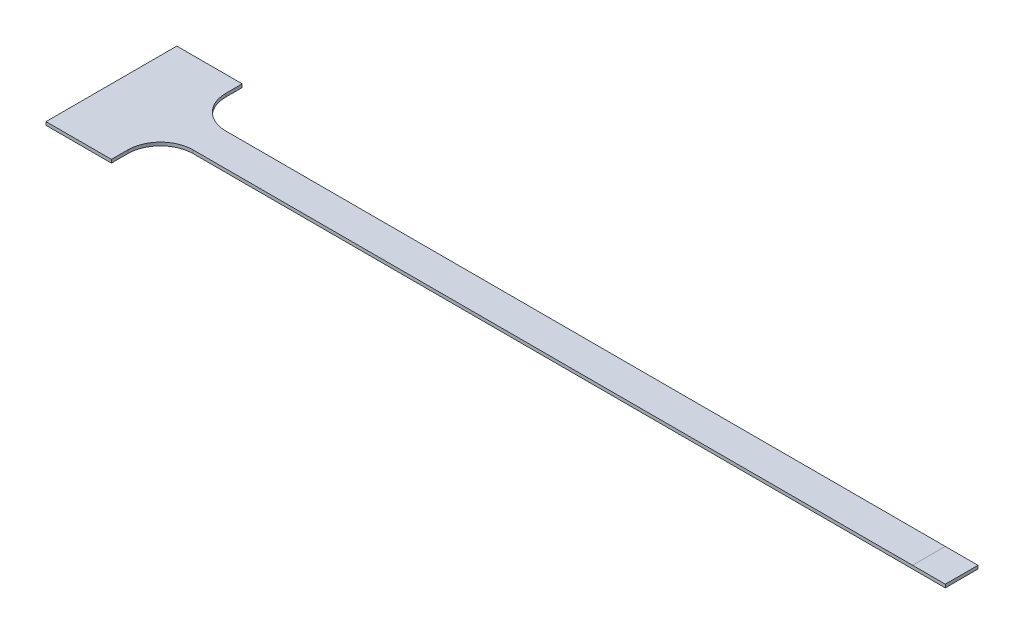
ISO-10303-21;
HEADER;
FILE_DESCRIPTION(('STEP AP214'),'2;1');
FILE_NAME('part.step','',(''),(''),'','','');
FILE_SCHEMA(('AUTOMOTIVE_DESIGN { 1 0 10303 214 1 1 1 1 }'));
ENDSEC;
DATA;
#1=APPLICATION_CONTEXT('core data for automotive mechanical design processes');
#2=APPLICATION_PROTOCOL_DEFINITION('international standard','automotive_design',2000,#1);
#3=PRODUCT_CONTEXT('',#1,'mechanical');
#4=PRODUCT('Part','Part','',(#3));
#5=PRODUCT_RELATED_PRODUCT_CATEGORY('part','',(#4));
#6=PRODUCT_DEFINITION_FORMATION('','',#4);
#7=PRODUCT_DEFINITION_CONTEXT('part definition',#1,'design');
#8=PRODUCT_DEFINITION('design','',#6,#7);
#9=PRODUCT_DEFINITION_SHAPE('','',#8);
#10=(LENGTH_UNIT() NAMED_UNIT(*) SI_UNIT(.MILLI.,.METRE.));
#11=(NAMED_UNIT(*) PLANE_ANGLE_UNIT() SI_UNIT($,.RADIAN.));
#12=(NAMED_UNIT(*) SI_UNIT($,.STERADIAN.) SOLID_ANGLE_UNIT());
#13=UNCERTAINTY_MEASURE_WITH_UNIT(LENGTH_MEASURE(1.E-05),#10,'distance_accuracy_value','');
#14=(GEOMETRIC_REPRESENTATION_CONTEXT(3) GLOBAL_UNCERTAINTY_ASSIGNED_CONTEXT((#13)) GLOBAL_UNIT_ASSIGNED_CONTEXT((#10,
#11,#12)) REPRESENTATION_CONTEXT('',''));
#15=CARTESIAN_POINT('',(0.,0.,0.));
#16=DIRECTION('',(0.,0.,1.));
#17=DIRECTION('',(1.,0.,0.));
#18=AXIS2_PLACEMENT_3D('',#15,#16,#17);
#19=CARTESIAN_POINT('',(-480.,1.,10.));
#20=DIRECTION('',(0.,1.,0.));
#21=DIRECTION('',(0.,0.,1.));
#22=AXIS2_PLACEMENT_3D('',#19,#20,#21);
#23=PLANE('',#22);
#24=DIRECTION('',(1.,0.,0.));
#25=VECTOR('',#24,1.);
#26=CARTESIAN_POINT('',(-480.,1.,10.));
#27=LINE('',#26,#25);
#28=CARTESIAN_POINT('',(-460.,1.,10.));
#29=VERTEX_POINT('',#28);
#30=CARTESIAN_POINT('',(-20.,1.,10.));
#31=VERTEX_POINT('',#30);
#32=EDGE_CURVE('E188',#29,#31,#27,.T.);
#33=ORIENTED_EDGE('',*,*,#32,.T.);
#34=DIRECTION('',(0.,0.,-1.));
#35=VECTOR('',#34,1.);
#36=CARTESIAN_POINT('',(-20.,1.,10.));
#37=LINE('',#36,#35);
#38=CARTESIAN_POINT('',(-20.,1.,-10.));
#39=VERTEX_POINT('',#38);
#40=EDGE_CURVE('E11',#31,#39,#37,.T.);
#41=ORIENTED_EDGE('',*,*,#40,.T.);
#42=DIRECTION('',(1.,0.,0.));
#43=VECTOR('',#42,1.);
#44=CARTESIAN_POINT('',(-480.,1.,-10.));
#45=LINE('',#44,#43);
#46=CARTESIAN_POINT('',(-460.,1.,-10.));
#47=VERTEX_POINT('',#46);
#48=EDGE_CURVE('E178',#47,#39,#45,.T.);
#49=ORIENTED_EDGE('',*,*,#48,.F.);
#50=CARTESIAN_POINT('',(-460.,1.,-30.));
#51=DIRECTION('',(0.,1.,0.));
#52=DIRECTION('',(0.,0.,1.));
#53=AXIS2_PLACEMENT_3D('',#50,#51,#52);
#54=CIRCLE('',#53,20.);
#55=CARTESIAN_POINT('',(-480.,1.,-30.));
#56=VERTEX_POINT('',#55);
#57=EDGE_CURVE('E227',#47,#56,#54,.F.);
#58=ORIENTED_EDGE('',*,*,#57,.T.);
#59=DIRECTION('',(0.,0.,-1.));
#60=VECTOR('',#59,1.);
#61=CARTESIAN_POINT('',(-480.,1.,-40.));
#62=LINE('',#61,#60);
#63=CARTESIAN_POINT('',(-480.,1.,-40.));
#64=VERTEX_POINT('',#63);
#65=EDGE_CURVE('E231',#56,#64,#62,.T.);
#66=ORIENTED_EDGE('',*,*,#65,.T.);
#67=DIRECTION('',(1.,0.,0.));
#68=VECTOR('',#67,1.);
#69=CARTESIAN_POINT('',(-520.,1.,-40.));
#70=LINE('',#69,#68);
#71=CARTESIAN_POINT('',(-520.,1.,-40.));
#72=VERTEX_POINT('',#71);
#73=EDGE_CURVE('E147',#72,#64,#70,.T.);
#74=ORIENTED_EDGE('',*,*,#73,.F.);
#75=DIRECTION('',(0.,0.,-1.));
#76=VECTOR('',#75,1.);
#77=CARTESIAN_POINT('',(-520.,1.,-40.));
#78=LINE('',#77,#76);
#79=CARTESIAN_POINT('',(-520.,1.,40.));
#80=VERTEX_POINT('',#79);
#81=EDGE_CURVE('E240',#80,#72,#78,.T.);
#82=ORIENTED_EDGE('',*,*,#81,.F.);
#83=DIRECTION('',(1.,0.,0.));
#84=VECTOR('',#83,1.);
#85=CARTESIAN_POINT('',(-520.,1.,40.));
#86=LINE('',#85,#84);
#87=CARTESIAN_POINT('',(-480.,1.,40.));
#88=VERTEX_POINT('',#87);
#89=EDGE_CURVE('E243',#80,#88,#86,.T.);
#90=ORIENTED_EDGE('',*,*,#89,.T.);
#91=CARTESIAN_POINT('',(-480.,1.,30.));
#92=VERTEX_POINT('',#91);
#93=EDGE_CURVE('E159',#88,#92,#62,.T.);
#94=ORIENTED_EDGE('',*,*,#93,.T.);
#95=CARTESIAN_POINT('',(-460.,1.,30.));
#96=DIRECTION('',(0.,1.,0.));
#97=DIRECTION('',(0.,0.,1.));
#98=AXIS2_PLACEMENT_3D('',#95,#96,#97);
#99=CIRCLE('',#98,20.);
#100=EDGE_CURVE('E221',#92,#29,#99,.F.);
#101=ORIENTED_EDGE('',*,*,#100,.T.);
#102=EDGE_LOOP('',(#33,#41,#49,#58,#66,#74,#82,#90,#94,#101));
#103=FACE_BOUND('',#102,.T.);
#104=ADVANCED_FACE('F38',(#103),#23,.T.);
#105=CARTESIAN_POINT('',(-480.,-1.,10.));
#106=DIRECTION('',(0.,0.,1.));
#107=DIRECTION('',(1.,0.,0.));
#108=AXIS2_PLACEMENT_3D('',#105,#106,#107);
#109=PLANE('',#108);
#110=ORIENTED_EDGE('',*,*,#32,.F.);
#111=DIRECTION('',(0.,-1.,0.));
#112=VECTOR('',#111,1.);
#113=CARTESIAN_POINT('',(-460.,-1.,10.));
#114=LINE('',#113,#112);
#115=CARTESIAN_POINT('',(-460.,-1.,10.));
#116=VERTEX_POINT('',#115);
#117=EDGE_CURVE('E194',#29,#116,#114,.T.);
#118=ORIENTED_EDGE('',*,*,#117,.T.);
#119=DIRECTION('',(1.,0.,0.));
#120=VECTOR('',#119,1.);
#121=CARTESIAN_POINT('',(-480.,-1.,10.));
#122=LINE('',#121,#120);
#123=CARTESIAN_POINT('',(0.,-1.,10.));
#124=VERTEX_POINT('',#123);
#125=EDGE_CURVE('E171',#116,#124,#122,.T.);
#126=ORIENTED_EDGE('',*,*,#125,.T.);
#127=DIRECTION('',(0.,-1.,0.));
#128=VECTOR('',#127,1.);
#129=CARTESIAN_POINT('',(0.,-1.,10.));
#130=LINE('',#129,#128);
#131=CARTESIAN_POINT('',(0.,1.,10.));
#132=VERTEX_POINT('',#131);
#133=EDGE_CURVE('E141',#132,#124,#130,.T.);
#134=ORIENTED_EDGE('',*,*,#133,.F.);
#135=EDGE_CURVE('E186',#31,#132,#27,.T.);
#136=ORIENTED_EDGE('',*,*,#135,.F.);
#137=EDGE_LOOP('',(#110,#118,#126,#134,#136));
#138=FACE_BOUND('',#137,.T.);
#139=ADVANCED_FACE('F40',(#138),#109,.T.);
#140=ORIENTED_EDGE('',*,*,#40,.F.);
#141=ORIENTED_EDGE('',*,*,#135,.T.);
#142=DIRECTION('',(0.,0.,1.));
#143=VECTOR('',#142,1.);
#144=CARTESIAN_POINT('',(0.,1.,10.));
#145=LINE('',#144,#143);
#146=CARTESIAN_POINT('',(0.,1.,-10.));
#147=VERTEX_POINT('',#146);
#148=EDGE_CURVE('E168',#147,#132,#145,.T.);
#149=ORIENTED_EDGE('',*,*,#148,.F.);
#150=EDGE_CURVE('E182',#39,#147,#45,.T.);
#151=ORIENTED_EDGE('',*,*,#150,.F.);
#152=EDGE_LOOP('',(#140,#141,#149,#151));
#153=FACE_BOUND('',#152,.T.);
#154=ADVANCED_FACE('F263',(#153),#23,.T.);
#155=CARTESIAN_POINT('',(-480.,-1.,-10.));
#156=DIRECTION('',(0.,0.,-1.));
#157=DIRECTION('',(-1.,0.,0.));
#158=AXIS2_PLACEMENT_3D('',#155,#156,#157);
#159=PLANE('',#158);
#160=DIRECTION('',(1.,0.,0.));
#161=VECTOR('',#160,1.);
#162=CARTESIAN_POINT('',(-480.,-1.,-10.));
#163=LINE('',#162,#161);
#164=CARTESIAN_POINT('',(-460.,-1.,-10.));
#165=VERTEX_POINT('',#164);
#166=CARTESIAN_POINT('',(0.,-1.,-10.));
#167=VERTEX_POINT('',#166);
#168=EDGE_CURVE('E184',#165,#167,#163,.T.);
#169=ORIENTED_EDGE('',*,*,#168,.F.);
#170=DIRECTION('',(0.,1.,0.));
#171=VECTOR('',#170,1.);
#172=CARTESIAN_POINT('',(-460.,1.,-10.));
#173=LINE('',#172,#171);
#174=EDGE_CURVE('E201',#165,#47,#173,.T.);
#175=ORIENTED_EDGE('',*,*,#174,.T.);
#176=ORIENTED_EDGE('',*,*,#48,.T.);
#177=ORIENTED_EDGE('',*,*,#150,.T.);
#178=DIRECTION('',(0.,1.,0.));
#179=VECTOR('',#178,1.);
#180=CARTESIAN_POINT('',(0.,-1.,-10.));
#181=LINE('',#180,#179);
#182=EDGE_CURVE('E165',#167,#147,#181,.T.);
#183=ORIENTED_EDGE('',*,*,#182,.F.);
#184=EDGE_LOOP('',(#169,#175,#176,#177,#183));
#185=FACE_BOUND('',#184,.T.);
#186=ADVANCED_FACE('F212',(#185),#159,.T.);
#187=CARTESIAN_POINT('',(-480.,-1.,10.));
#188=DIRECTION('',(0.,-1.,0.));
#189=DIRECTION('',(0.,0.,-1.));
#190=AXIS2_PLACEMENT_3D('',#187,#188,#189);
#191=PLANE('',#190);
#192=DIRECTION('',(0.,0.,-1.));
#193=VECTOR('',#192,1.);
#194=CARTESIAN_POINT('',(0.,-1.,10.));
#195=LINE('',#194,#193);
#196=EDGE_CURVE('E162',#124,#167,#195,.T.);
#197=ORIENTED_EDGE('',*,*,#196,.F.);
#198=ORIENTED_EDGE('',*,*,#125,.F.);
#199=CARTESIAN_POINT('',(-460.,-1.,30.));
#200=DIRECTION('',(0.,-1.,0.));
#201=DIRECTION('',(0.,0.,-1.));
#202=AXIS2_PLACEMENT_3D('',#199,#200,#201);
#203=CIRCLE('',#202,20.);
#204=CARTESIAN_POINT('',(-480.,-1.,30.));
#205=VERTEX_POINT('',#204);
#206=EDGE_CURVE('E218',#116,#205,#203,.F.);
#207=ORIENTED_EDGE('',*,*,#206,.T.);
#208=DIRECTION('',(0.,0.,1.));
#209=VECTOR('',#208,1.);
#210=CARTESIAN_POINT('',(-480.,-1.,-40.));
#211=LINE('',#210,#209);
#212=CARTESIAN_POINT('',(-480.,-1.,40.));
#213=VERTEX_POINT('',#212);
#214=EDGE_CURVE('E130',#205,#213,#211,.T.);
#215=ORIENTED_EDGE('',*,*,#214,.T.);
#216=DIRECTION('',(1.,0.,0.));
#217=VECTOR('',#216,1.);
#218=CARTESIAN_POINT('',(-520.,-1.,40.));
#219=LINE('',#218,#217);
#220=CARTESIAN_POINT('',(-520.,-1.,40.));
#221=VERTEX_POINT('',#220);
#222=EDGE_CURVE('E142',#221,#213,#219,.T.);
#223=ORIENTED_EDGE('',*,*,#222,.F.);
#224=DIRECTION('',(0.,0.,1.));
#225=VECTOR('',#224,1.);
#226=CARTESIAN_POINT('',(-520.,-1.,-40.));
#227=LINE('',#226,#225);
#228=CARTESIAN_POINT('',(-520.,-1.,-40.));
#229=VERTEX_POINT('',#228);
#230=EDGE_CURVE('E137',#229,#221,#227,.T.);
#231=ORIENTED_EDGE('',*,*,#230,.F.);
#232=DIRECTION('',(1.,0.,0.));
#233=VECTOR('',#232,1.);
#234=CARTESIAN_POINT('',(-520.,-1.,-40.));
#235=LINE('',#234,#233);
#236=CARTESIAN_POINT('',(-480.,-1.,-40.));
#237=VERTEX_POINT('',#236);
#238=EDGE_CURVE('E133',#229,#237,#235,.T.);
#239=ORIENTED_EDGE('',*,*,#238,.T.);
#240=CARTESIAN_POINT('',(-480.,-1.,-30.));
#241=VERTEX_POINT('',#240);
#242=EDGE_CURVE('E119',#237,#241,#211,.T.);
#243=ORIENTED_EDGE('',*,*,#242,.T.);
#244=CARTESIAN_POINT('',(-460.,-1.,-30.));
#245=DIRECTION('',(0.,-1.,0.));
#246=DIRECTION('',(0.,0.,-1.));
#247=AXIS2_PLACEMENT_3D('',#244,#245,#246);
#248=CIRCLE('',#247,20.);
#249=EDGE_CURVE('E47',#241,#165,#248,.F.);
#250=ORIENTED_EDGE('',*,*,#249,.T.);
#251=ORIENTED_EDGE('',*,*,#168,.T.);
#252=EDGE_LOOP('',(#197,#198,#207,#215,#223,#231,#239,#243,#250,#251));
#253=FACE_BOUND('',#252,.T.);
#254=ADVANCED_FACE('F135',(#253),#191,.T.);
#255=CARTESIAN_POINT('',(0.,-1.,10.));
#256=DIRECTION('',(-1.,0.,0.));
#257=DIRECTION('',(0.,0.,1.));
#258=AXIS2_PLACEMENT_3D('',#255,#256,#257);
#259=PLANE('',#258);
#260=ORIENTED_EDGE('',*,*,#133,.T.);
#261=ORIENTED_EDGE('',*,*,#196,.T.);
#262=ORIENTED_EDGE('',*,*,#182,.T.);
#263=ORIENTED_EDGE('',*,*,#148,.T.);
#264=EDGE_LOOP('',(#260,#261,#262,#263));
#265=FACE_BOUND('',#264,.T.);
#266=ADVANCED_FACE('F216',(#265),#259,.F.);
#267=CARTESIAN_POINT('',(-480.,1.,-40.));
#268=DIRECTION('',(1.,0.,0.));
#269=DIRECTION('',(0.,0.,-1.));
#270=AXIS2_PLACEMENT_3D('',#267,#268,#269);
#271=PLANE('',#270);
#272=ORIENTED_EDGE('',*,*,#214,.F.);
#273=DIRECTION('',(0.,-1.,0.));
#274=VECTOR('',#273,1.);
#275=CARTESIAN_POINT('',(-480.,1.,30.));
#276=LINE('',#275,#274);
#277=EDGE_CURVE('E196',#205,#92,#276,.F.);
#278=ORIENTED_EDGE('',*,*,#277,.T.);
#279=ORIENTED_EDGE('',*,*,#93,.F.);
#280=DIRECTION('',(0.,1.,0.));
#281=VECTOR('',#280,1.);
#282=CARTESIAN_POINT('',(-480.,-1.,40.));
#283=LINE('',#282,#281);
#284=EDGE_CURVE('E129',#213,#88,#283,.T.);
#285=ORIENTED_EDGE('',*,*,#284,.F.);
#286=EDGE_LOOP('',(#272,#278,#279,#285));
#287=FACE_BOUND('',#286,.T.);
#288=ADVANCED_FACE('F224',(#287),#271,.T.);
#289=ORIENTED_EDGE('',*,*,#65,.F.);
#290=DIRECTION('',(0.,1.,0.));
#291=VECTOR('',#290,1.);
#292=CARTESIAN_POINT('',(-480.,-1.,-30.));
#293=LINE('',#292,#291);
#294=EDGE_CURVE('E126',#56,#241,#293,.F.);
#295=ORIENTED_EDGE('',*,*,#294,.T.);
#296=ORIENTED_EDGE('',*,*,#242,.F.);
#297=DIRECTION('',(0.,-1.,0.));
#298=VECTOR('',#297,1.);
#299=CARTESIAN_POINT('',(-480.,-1.,-40.));
#300=LINE('',#299,#298);
#301=EDGE_CURVE('E124',#64,#237,#300,.T.);
#302=ORIENTED_EDGE('',*,*,#301,.F.);
#303=EDGE_LOOP('',(#289,#295,#296,#302));
#304=FACE_BOUND('',#303,.T.);
#305=ADVANCED_FACE('F122',(#304),#271,.T.);
#306=CARTESIAN_POINT('',(-520.,-1.,-40.));
#307=DIRECTION('',(0.,0.,1.));
#308=DIRECTION('',(1.,0.,0.));
#309=AXIS2_PLACEMENT_3D('',#306,#307,#308);
#310=PLANE('',#309);
#311=ORIENTED_EDGE('',*,*,#301,.T.);
#312=ORIENTED_EDGE('',*,*,#238,.F.);
#313=DIRECTION('',(0.,-1.,0.));
#314=VECTOR('',#313,1.);
#315=CARTESIAN_POINT('',(-520.,-1.,-40.));
#316=LINE('',#315,#314);
#317=EDGE_CURVE('E234',#72,#229,#316,.T.);
#318=ORIENTED_EDGE('',*,*,#317,.F.);
#319=ORIENTED_EDGE('',*,*,#73,.T.);
#320=EDGE_LOOP('',(#311,#312,#318,#319));
#321=FACE_BOUND('',#320,.T.);
#322=ADVANCED_FACE('F145',(#321),#310,.F.);
#323=CARTESIAN_POINT('',(-520.,-1.,40.));
#324=DIRECTION('',(0.,0.,-1.));
#325=DIRECTION('',(-1.,0.,0.));
#326=AXIS2_PLACEMENT_3D('',#323,#324,#325);
#327=PLANE('',#326);
#328=ORIENTED_EDGE('',*,*,#284,.T.);
#329=ORIENTED_EDGE('',*,*,#89,.F.);
#330=DIRECTION('',(0.,1.,0.));
#331=VECTOR('',#330,1.);
#332=CARTESIAN_POINT('',(-520.,-1.,40.));
#333=LINE('',#332,#331);
#334=EDGE_CURVE('E238',#221,#80,#333,.T.);
#335=ORIENTED_EDGE('',*,*,#334,.F.);
#336=ORIENTED_EDGE('',*,*,#222,.T.);
#337=EDGE_LOOP('',(#328,#329,#335,#336));
#338=FACE_BOUND('',#337,.T.);
#339=ADVANCED_FACE('F248',(#338),#327,.F.);
#340=CARTESIAN_POINT('',(-520.,1.,-40.));
#341=DIRECTION('',(1.,0.,0.));
#342=DIRECTION('',(0.,0.,-1.));
#343=AXIS2_PLACEMENT_3D('',#340,#341,#342);
#344=PLANE('',#343);
#345=ORIENTED_EDGE('',*,*,#317,.T.);
#346=ORIENTED_EDGE('',*,*,#230,.T.);
#347=ORIENTED_EDGE('',*,*,#334,.T.);
#348=ORIENTED_EDGE('',*,*,#81,.T.);
#349=EDGE_LOOP('',(#345,#346,#347,#348));
#350=FACE_BOUND('',#349,.T.);
#351=ADVANCED_FACE('F252',(#350),#344,.F.);
#352=CARTESIAN_POINT('',(-460.,-1.,30.));
#353=DIRECTION('',(0.,1.,0.));
#354=DIRECTION('',(0.,0.,1.));
#355=AXIS2_PLACEMENT_3D('',#352,#353,#354);
#356=CYLINDRICAL_SURFACE('',#355,20.);
#357=ORIENTED_EDGE('',*,*,#100,.F.);
#358=ORIENTED_EDGE('',*,*,#277,.F.);
#359=ORIENTED_EDGE('',*,*,#206,.F.);
#360=ORIENTED_EDGE('',*,*,#117,.F.);
#361=EDGE_LOOP('',(#357,#358,#359,#360));
#362=FACE_BOUND('',#361,.T.);
#363=ADVANCED_FACE('F226',(#362),#356,.F.);
#364=CARTESIAN_POINT('',(-460.,-1.,-30.));
#365=DIRECTION('',(0.,-1.,0.));
#366=DIRECTION('',(0.,0.,-1.));
#367=AXIS2_PLACEMENT_3D('',#364,#365,#366);
#368=CYLINDRICAL_SURFACE('',#367,20.);
#369=ORIENTED_EDGE('',*,*,#249,.F.);
#370=ORIENTED_EDGE('',*,*,#294,.F.);
#371=ORIENTED_EDGE('',*,*,#57,.F.);
#372=ORIENTED_EDGE('',*,*,#174,.F.);
#373=EDGE_LOOP('',(#369,#370,#371,#372));
#374=FACE_BOUND('',#373,.T.);
#375=ADVANCED_FACE('F254',(#374),#368,.F.);
#376=CLOSED_SHELL('',(#104,#139,#154,#186,#254,#266,#288,#305,#322,#339,#351,#363,#375));
#377=MANIFOLD_SOLID_BREP('B2',#376);
#378=ADVANCED_BREP_SHAPE_REPRESENTATION('',(#18,#377),#14);
#379=SHAPE_DEFINITION_REPRESENTATION(#9,#378);
ENDSEC;
END-ISO-10303-21;
